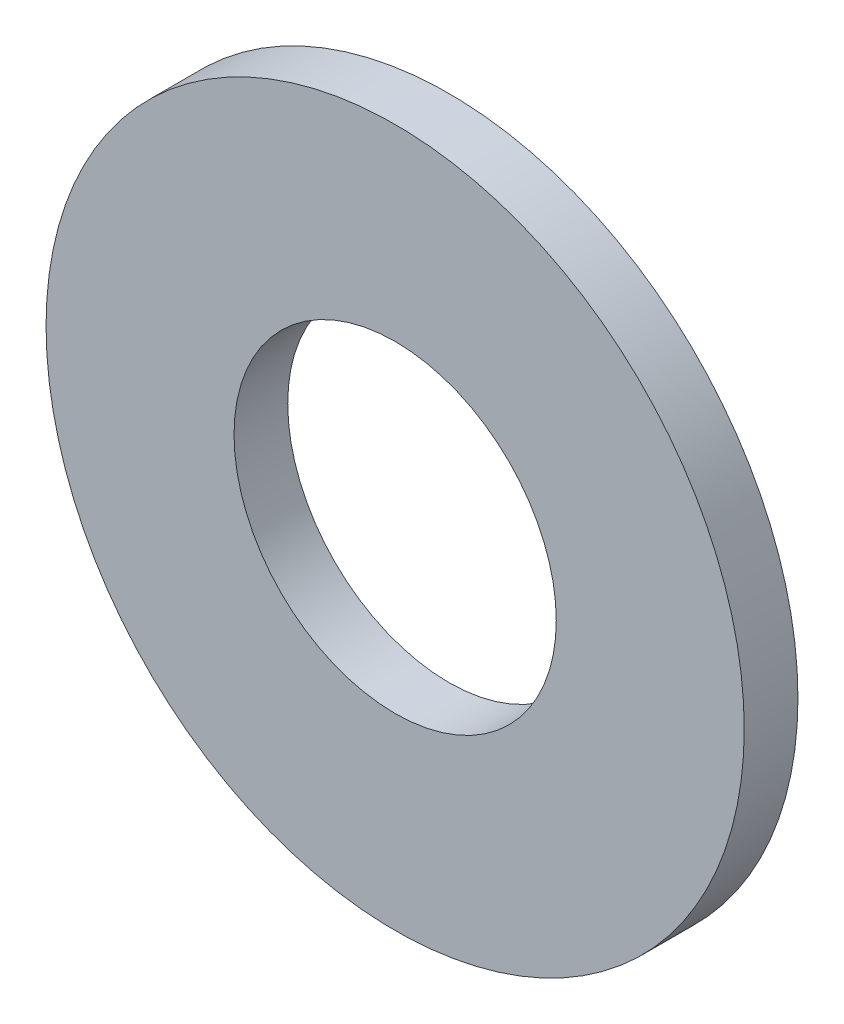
from build123d import *

# Parameters (mm, degrees)
ESQUISSE1_R      = 3.25
ESQUISSE1_R_2    = 1.5
EXTRUSION1_DEPTH = 0.5


with BuildPart() as part:
    # Esquisse1 → Extrusion1 (new body)
    with BuildSketch(Plane.XY):
        Circle(ESQUISSE1_R)
        Circle(ESQUISSE1_R_2, mode=Mode.SUBTRACT)
    extrude(amount=EXTRUSION1_DEPTH)


solid = part.part
